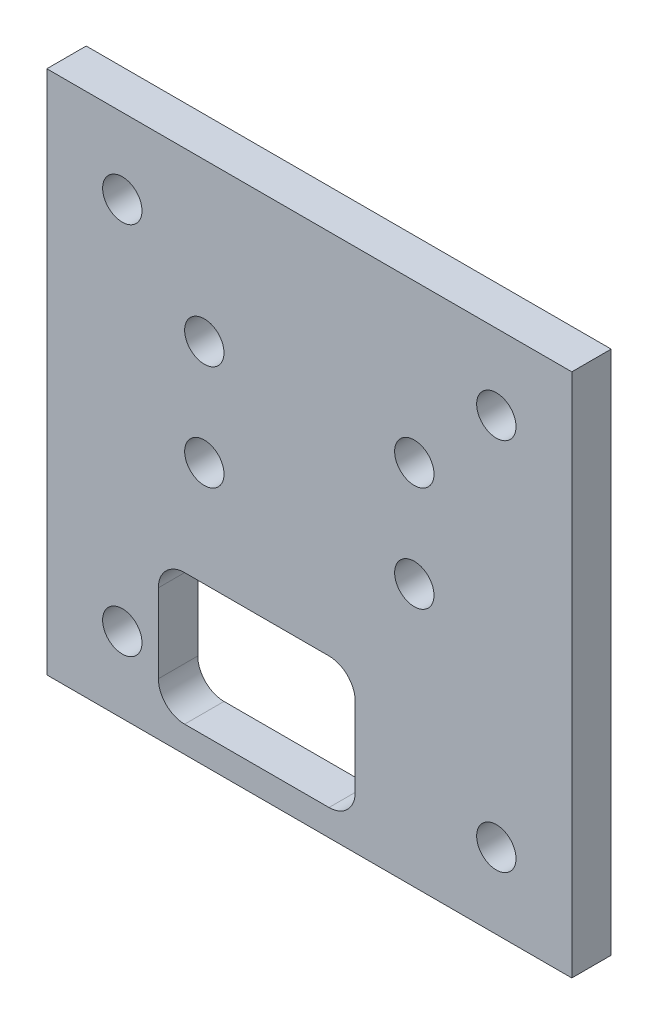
from build123d import *

# Parameters (mm, degrees)
SKETCH_1_W                = 40
SKETCH_1_H                = 40
EXTRUDE_1_DEPTH           = 3
HOLE_WIZARD_3_0_3_1_D     = 3
HOLE_WIZARD_3_0_3_1_DEPTH = 5
HOLE_WIZARD_3_0_3_1_TIP   = 0.901290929
SKETCH_4_W                = 15
SKETCH_4_H                = 10
CUT_EXTRUDE_1_DEPTH       = 3
FILLET_1_R                = 2
HOLE_WIZARD_3_0_3_2_D     = 3


with BuildPart() as part:
    # Sketch 1 → Extrude 1 (new body)
    with BuildSketch(Plane.XY):
        Rectangle(SKETCH_1_W, SKETCH_1_H)
    extrude(amount=EXTRUDE_1_DEPTH)

    # Hole Wizard 3.0 _3_ _1
    with Locations(Plane.XY.offset(3)):
        with Locations((-14.25, 14.25), (14.25, 14.25), (14.25, -14.25), (-14.25, -14.25)):
            Hole(HOLE_WIZARD_3_0_3_1_D / 2, depth=HOLE_WIZARD_3_0_3_1_DEPTH)
            with Locations((0, 0, -(HOLE_WIZARD_3_0_3_1_DEPTH + HOLE_WIZARD_3_0_3_1_TIP / 2))):  # 118° drill point
                Cone(0, HOLE_WIZARD_3_0_3_1_D / 2, HOLE_WIZARD_3_0_3_1_TIP, mode=Mode.SUBTRACT)

    # Sketch 4 → Cut-Extrude 1 (cut)
    with BuildSketch(Plane.XY.offset(3)):
        with Locations((-4, -13)):
            Rectangle(SKETCH_4_W, SKETCH_4_H)
    extrude(amount=-CUT_EXTRUDE_1_DEPTH, mode=Mode.SUBTRACT)

    # Fillet 1
    fillet_1_edges = [part.edges().sort_by_distance(p)[0] for p in [
        (3.5, -8, 1.5),
        (3.5, -18, 1.5),
        (-11.5, -18, 1.5),
        (-11.5, -8, 1.5),
    ]]
    fillet(fillet_1_edges, radius=FILLET_1_R)

    # Hole Wizard 3.0 _3_ _2 (through all)
    with Locations(Plane.XY.offset(3)):
        with Locations((-8, 8), (-8, 0), (8, 0), (8, 8)):
            Hole(HOLE_WIZARD_3_0_3_2_D / 2)


solid = part.part
